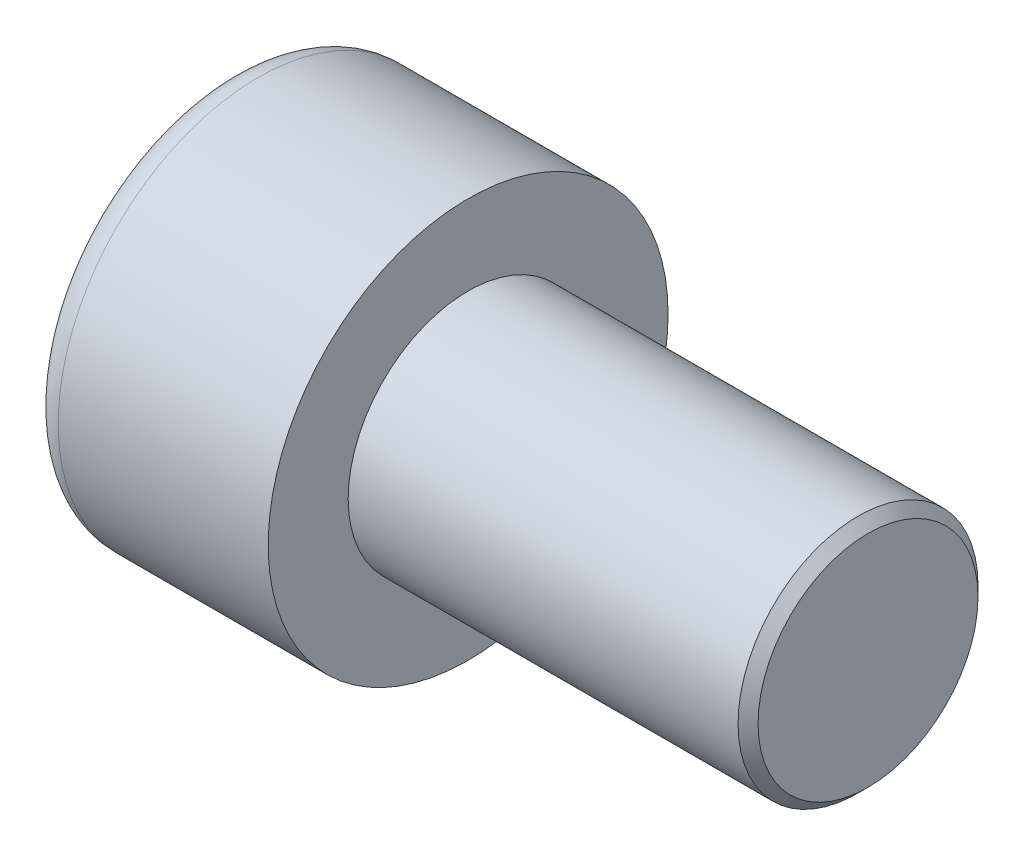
from build123d import *

# Parameters (mm, degrees)
SKETCH1_R           = 5
BASEHEAD_DEPTH      = 6
SKETCH2_R           = 3
BASEBODY_DEPTH      = 10
HEXAGONSOCKET_DEPTH = 3
TOPFILLET_R         = 0.75
CHAMFER1_SIZE       = 0.25


with BuildPart() as part:
    # Sketch1 → BaseHead (new body)
    with BuildSketch(Plane(origin=(0, 0, 0), x_dir=(0, 0, -1), z_dir=(1, 0, 0))):
        Circle(SKETCH1_R)
    extrude(amount=BASEHEAD_DEPTH)

    # Sketch2 → BaseBody (add)
    with BuildSketch(Plane(origin=(6, 0, 0), x_dir=(0, 0, -1), z_dir=(1, 0, 0))):
        Circle(SKETCH2_R)
    extrude(amount=BASEBODY_DEPTH)

    # Sketch3 → HexagonSocket (cut)
    with BuildSketch(Plane(origin=(0, 0, 0), x_dir=(0, 0, -1), z_dir=(1, 0, 0))):
        Polygon((2.886751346, 0), (1.443375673, 2.5), (-1.443375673, 2.5), (-2.886751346, 0), (-1.443375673, -2.5), (1.443375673, -2.5), align=None)
    extrude(amount=HEXAGONSOCKET_DEPTH, mode=Mode.SUBTRACT)

    # Sketch4 → Cut-Revolve1 (revolve, cut)
    with BuildSketch(Plane(origin=(-4.19613823, 0.75, 0), x_dir=(-1, 0, 0), z_dir=(0, 0, 1)), mode=Mode.PRIVATE) as cut_revolve1_sk:
        Polygon((-7.19613823, 3.25), (-8.639513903, 0.75), (-7.19613823, 0.75), align=None)
    revolve(cut_revolve1_sk.sketch.rotate(Axis((0.838992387, 0, 0), (-1, 0, 0)), 90), axis=Axis((0.838992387, 0, 0), (-1, 0, 0)), mode=Mode.SUBTRACT)

    # TopFillet
    topfillet_edges = [part.edges().sort_by_distance(p)[0] for p in [
        (0, 0, 5),
    ]]
    fillet(topfillet_edges, radius=TOPFILLET_R)

    # Chamfer1
    chamfer1_edges = [part.edges().sort_by_distance(p)[0] for p in [
        (16, 0, 3),
    ]]
    chamfer(chamfer1_edges, length=CHAMFER1_SIZE)


solid = part.part
